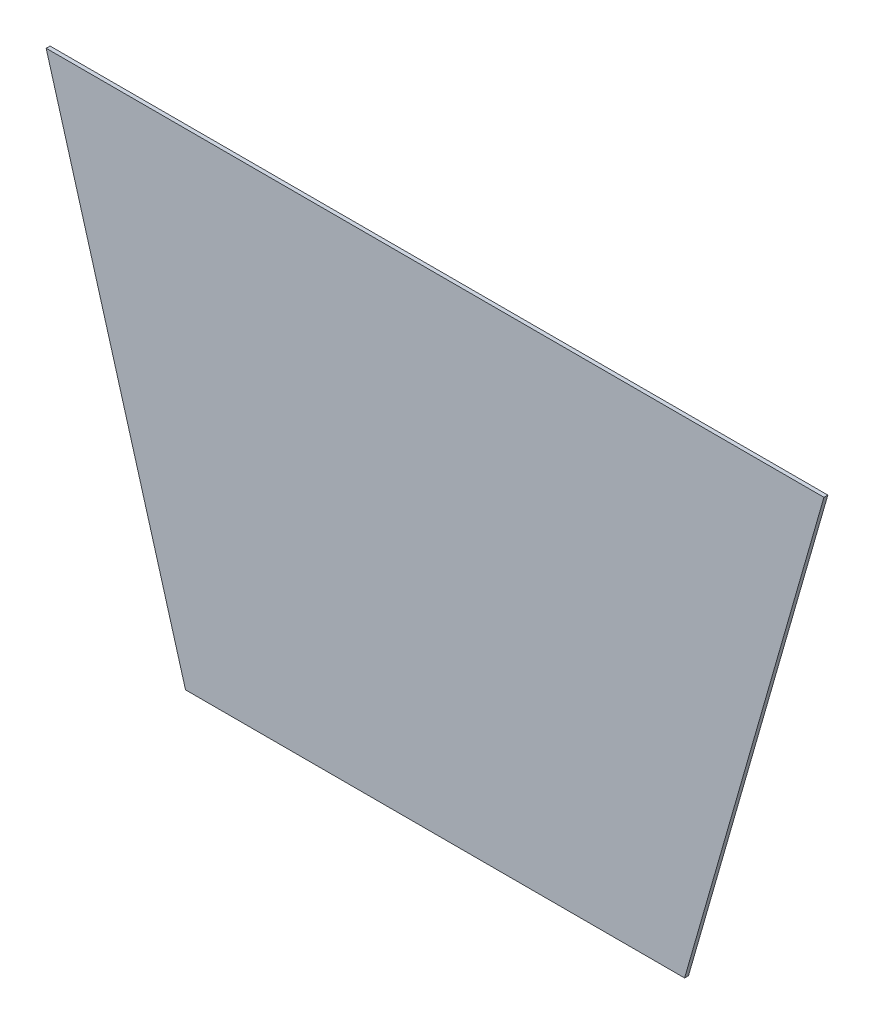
ISO-10303-21;
HEADER;
FILE_DESCRIPTION(('STEP AP214'),'2;1');
FILE_NAME('part.step','',(''),(''),'','','');
FILE_SCHEMA(('AUTOMOTIVE_DESIGN { 1 0 10303 214 1 1 1 1 }'));
ENDSEC;
DATA;
#1=APPLICATION_CONTEXT('core data for automotive mechanical design processes');
#2=APPLICATION_PROTOCOL_DEFINITION('international standard','automotive_design',2000,#1);
#3=PRODUCT_CONTEXT('',#1,'mechanical');
#4=PRODUCT('Part','Part','',(#3));
#5=PRODUCT_RELATED_PRODUCT_CATEGORY('part','',(#4));
#6=PRODUCT_DEFINITION_FORMATION('','',#4);
#7=PRODUCT_DEFINITION_CONTEXT('part definition',#1,'design');
#8=PRODUCT_DEFINITION('design','',#6,#7);
#9=PRODUCT_DEFINITION_SHAPE('','',#8);
#10=(LENGTH_UNIT() NAMED_UNIT(*) SI_UNIT(.MILLI.,.METRE.));
#11=(NAMED_UNIT(*) PLANE_ANGLE_UNIT() SI_UNIT($,.RADIAN.));
#12=(NAMED_UNIT(*) SI_UNIT($,.STERADIAN.) SOLID_ANGLE_UNIT());
#13=UNCERTAINTY_MEASURE_WITH_UNIT(LENGTH_MEASURE(1.E-05),#10,'distance_accuracy_value','');
#14=(GEOMETRIC_REPRESENTATION_CONTEXT(3) GLOBAL_UNCERTAINTY_ASSIGNED_CONTEXT((#13)) GLOBAL_UNIT_ASSIGNED_CONTEXT((#10,
#11,#12)) REPRESENTATION_CONTEXT('',''));
#15=CARTESIAN_POINT('',(0.,0.,0.));
#16=DIRECTION('',(0.,0.,1.));
#17=DIRECTION('',(1.,0.,0.));
#18=AXIS2_PLACEMENT_3D('',#15,#16,#17);
#19=CARTESIAN_POINT('',(-300.,374.891651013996,3.));
#20=DIRECTION('',(0.961260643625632,0.275641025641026,0.));
#21=DIRECTION('',(-0.275641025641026,0.961260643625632,0.));
#22=AXIS2_PLACEMENT_3D('',#19,#20,#21);
#23=PLANE('',#22);
#24=DIRECTION('',(0.275641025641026,-0.961260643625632,0.));
#25=VECTOR('',#24,1.);
#26=CARTESIAN_POINT('',(-300.,374.891651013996,0.));
#27=LINE('',#26,#25);
#28=CARTESIAN_POINT('',(-300.,374.891651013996,0.));
#29=VERTEX_POINT('',#28);
#30=CARTESIAN_POINT('',(-192.5,0.,0.));
#31=VERTEX_POINT('',#30);
#32=EDGE_CURVE('E98',#29,#31,#27,.T.);
#33=ORIENTED_EDGE('',*,*,#32,.T.);
#34=DIRECTION('',(0.,0.,-1.));
#35=VECTOR('',#34,1.);
#36=CARTESIAN_POINT('',(-192.5,0.,3.));
#37=LINE('',#36,#35);
#38=CARTESIAN_POINT('',(-192.5,0.,3.));
#39=VERTEX_POINT('',#38);
#40=EDGE_CURVE('E11',#39,#31,#37,.T.);
#41=ORIENTED_EDGE('',*,*,#40,.F.);
#42=DIRECTION('',(0.275641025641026,-0.961260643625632,0.));
#43=VECTOR('',#42,1.);
#44=CARTESIAN_POINT('',(-300.,374.891651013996,3.));
#45=LINE('',#44,#43);
#46=CARTESIAN_POINT('',(-300.,374.891651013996,3.));
#47=VERTEX_POINT('',#46);
#48=EDGE_CURVE('E86',#47,#39,#45,.T.);
#49=ORIENTED_EDGE('',*,*,#48,.F.);
#50=DIRECTION('',(0.,0.,-1.));
#51=VECTOR('',#50,1.);
#52=CARTESIAN_POINT('',(-300.,374.891651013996,3.));
#53=LINE('',#52,#51);
#54=EDGE_CURVE('E94',#47,#29,#53,.T.);
#55=ORIENTED_EDGE('',*,*,#54,.T.);
#56=EDGE_LOOP('',(#33,#41,#49,#55));
#57=FACE_BOUND('',#56,.T.);
#58=ADVANCED_FACE('F35',(#57),#23,.F.);
#59=CARTESIAN_POINT('',(-192.5,0.,3.));
#60=DIRECTION('',(0.,1.,0.));
#61=DIRECTION('',(0.,0.,1.));
#62=AXIS2_PLACEMENT_3D('',#59,#60,#61);
#63=PLANE('',#62);
#64=DIRECTION('',(1.,0.,0.));
#65=VECTOR('',#64,1.);
#66=CARTESIAN_POINT('',(-192.5,0.,0.));
#67=LINE('',#66,#65);
#68=CARTESIAN_POINT('',(192.5,0.,0.));
#69=VERTEX_POINT('',#68);
#70=EDGE_CURVE('E90',#31,#69,#67,.T.);
#71=ORIENTED_EDGE('',*,*,#70,.T.);
#72=DIRECTION('',(0.,0.,-1.));
#73=VECTOR('',#72,1.);
#74=CARTESIAN_POINT('',(192.5,0.,3.));
#75=LINE('',#74,#73);
#76=CARTESIAN_POINT('',(192.5,0.,3.));
#77=VERTEX_POINT('',#76);
#78=EDGE_CURVE('E43',#77,#69,#75,.T.);
#79=ORIENTED_EDGE('',*,*,#78,.F.);
#80=DIRECTION('',(1.,0.,0.));
#81=VECTOR('',#80,1.);
#82=CARTESIAN_POINT('',(-192.5,0.,3.));
#83=LINE('',#82,#81);
#84=EDGE_CURVE('E81',#39,#77,#83,.T.);
#85=ORIENTED_EDGE('',*,*,#84,.F.);
#86=ORIENTED_EDGE('',*,*,#40,.T.);
#87=EDGE_LOOP('',(#71,#79,#85,#86));
#88=FACE_BOUND('',#87,.T.);
#89=ADVANCED_FACE('F89',(#88),#63,.F.);
#90=CARTESIAN_POINT('',(300.,374.891651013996,3.));
#91=DIRECTION('',(-0.961260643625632,0.275641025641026,0.));
#92=DIRECTION('',(-0.275641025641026,-0.961260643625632,0.));
#93=AXIS2_PLACEMENT_3D('',#90,#91,#92);
#94=PLANE('',#93);
#95=DIRECTION('',(0.275641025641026,0.961260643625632,0.));
#96=VECTOR('',#95,1.);
#97=CARTESIAN_POINT('',(300.,374.891651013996,0.));
#98=LINE('',#97,#96);
#99=CARTESIAN_POINT('',(300.,374.891651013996,0.));
#100=VERTEX_POINT('',#99);
#101=EDGE_CURVE('E68',#69,#100,#98,.T.);
#102=ORIENTED_EDGE('',*,*,#101,.T.);
#103=DIRECTION('',(0.,0.,-1.));
#104=VECTOR('',#103,1.);
#105=CARTESIAN_POINT('',(300.,374.891651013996,3.));
#106=LINE('',#105,#104);
#107=CARTESIAN_POINT('',(300.,374.891651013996,3.));
#108=VERTEX_POINT('',#107);
#109=EDGE_CURVE('E91',#108,#100,#106,.T.);
#110=ORIENTED_EDGE('',*,*,#109,.F.);
#111=DIRECTION('',(0.275641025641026,0.961260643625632,0.));
#112=VECTOR('',#111,1.);
#113=CARTESIAN_POINT('',(300.,374.891651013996,3.));
#114=LINE('',#113,#112);
#115=EDGE_CURVE('E84',#77,#108,#114,.T.);
#116=ORIENTED_EDGE('',*,*,#115,.F.);
#117=ORIENTED_EDGE('',*,*,#78,.T.);
#118=EDGE_LOOP('',(#102,#110,#116,#117));
#119=FACE_BOUND('',#118,.T.);
#120=ADVANCED_FACE('F92',(#119),#94,.F.);
#121=CARTESIAN_POINT('',(-300.,374.891651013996,3.));
#122=DIRECTION('',(0.,-1.,0.));
#123=DIRECTION('',(0.,0.,-1.));
#124=AXIS2_PLACEMENT_3D('',#121,#122,#123);
#125=PLANE('',#124);
#126=DIRECTION('',(-1.,0.,0.));
#127=VECTOR('',#126,1.);
#128=CARTESIAN_POINT('',(-300.,374.891651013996,0.));
#129=LINE('',#128,#127);
#130=EDGE_CURVE('E74',#100,#29,#129,.T.);
#131=ORIENTED_EDGE('',*,*,#130,.T.);
#132=ORIENTED_EDGE('',*,*,#54,.F.);
#133=DIRECTION('',(-1.,0.,0.));
#134=VECTOR('',#133,1.);
#135=CARTESIAN_POINT('',(-300.,374.891651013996,3.));
#136=LINE('',#135,#134);
#137=EDGE_CURVE('E51',#108,#47,#136,.T.);
#138=ORIENTED_EDGE('',*,*,#137,.F.);
#139=ORIENTED_EDGE('',*,*,#109,.T.);
#140=EDGE_LOOP('',(#131,#132,#138,#139));
#141=FACE_BOUND('',#140,.T.);
#142=ADVANCED_FACE('F105',(#141),#125,.F.);
#143=CARTESIAN_POINT('',(0.,0.,3.));
#144=DIRECTION('',(0.,0.,1.));
#145=DIRECTION('',(1.,0.,0.));
#146=AXIS2_PLACEMENT_3D('',#143,#144,#145);
#147=PLANE('',#146);
#148=ORIENTED_EDGE('',*,*,#48,.T.);
#149=ORIENTED_EDGE('',*,*,#84,.T.);
#150=ORIENTED_EDGE('',*,*,#115,.T.);
#151=ORIENTED_EDGE('',*,*,#137,.T.);
#152=EDGE_LOOP('',(#148,#149,#150,#151));
#153=FACE_BOUND('',#152,.T.);
#154=ADVANCED_FACE('F82',(#153),#147,.T.);
#155=CARTESIAN_POINT('',(0.,0.,0.));
#156=DIRECTION('',(0.,0.,1.));
#157=DIRECTION('',(1.,0.,0.));
#158=AXIS2_PLACEMENT_3D('',#155,#156,#157);
#159=PLANE('',#158);
#160=ORIENTED_EDGE('',*,*,#32,.F.);
#161=ORIENTED_EDGE('',*,*,#130,.F.);
#162=ORIENTED_EDGE('',*,*,#101,.F.);
#163=ORIENTED_EDGE('',*,*,#70,.F.);
#164=EDGE_LOOP('',(#160,#161,#162,#163));
#165=FACE_BOUND('',#164,.T.);
#166=ADVANCED_FACE('F108',(#165),#159,.F.);
#167=CLOSED_SHELL('',(#58,#89,#120,#142,#154,#166));
#168=MANIFOLD_SOLID_BREP('B2',#167);
#169=ADVANCED_BREP_SHAPE_REPRESENTATION('',(#18,#168),#14);
#170=SHAPE_DEFINITION_REPRESENTATION(#9,#169);
ENDSEC;
END-ISO-10303-21;
